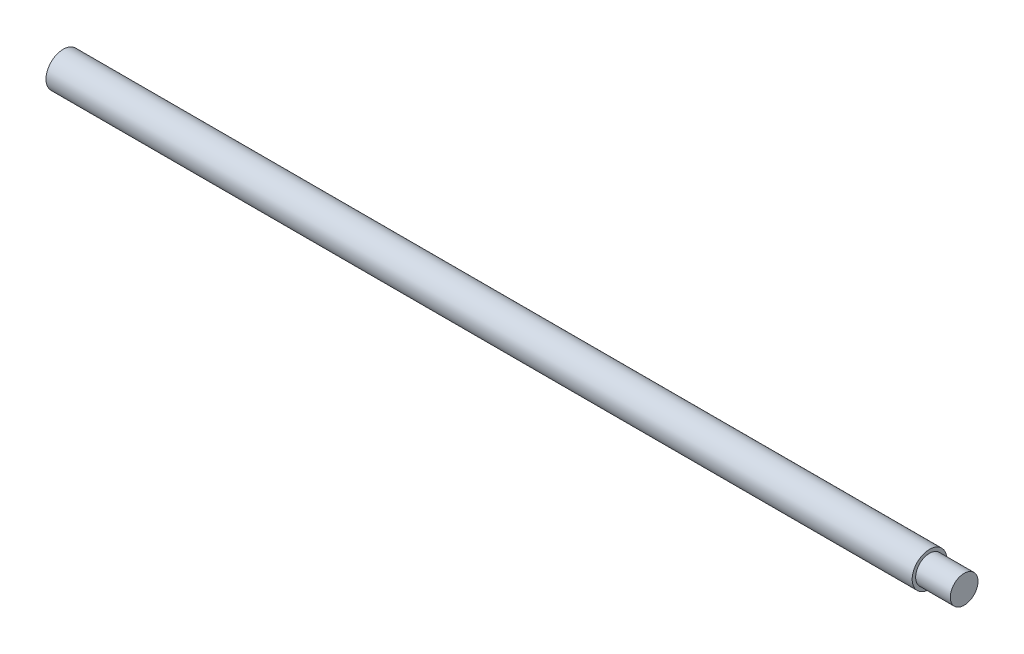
ISO-10303-21;
HEADER;
FILE_DESCRIPTION(('STEP AP214'),'2;1');
FILE_NAME('part.step','',(''),(''),'','','');
FILE_SCHEMA(('AUTOMOTIVE_DESIGN { 1 0 10303 214 1 1 1 1 }'));
ENDSEC;
DATA;
#1=APPLICATION_CONTEXT('core data for automotive mechanical design processes');
#2=APPLICATION_PROTOCOL_DEFINITION('international standard','automotive_design',2000,#1);
#3=PRODUCT_CONTEXT('',#1,'mechanical');
#4=PRODUCT('Part','Part','',(#3));
#5=PRODUCT_RELATED_PRODUCT_CATEGORY('part','',(#4));
#6=PRODUCT_DEFINITION_FORMATION('','',#4);
#7=PRODUCT_DEFINITION_CONTEXT('part definition',#1,'design');
#8=PRODUCT_DEFINITION('design','',#6,#7);
#9=PRODUCT_DEFINITION_SHAPE('','',#8);
#10=(LENGTH_UNIT() NAMED_UNIT(*) SI_UNIT(.MILLI.,.METRE.));
#11=(NAMED_UNIT(*) PLANE_ANGLE_UNIT() SI_UNIT($,.RADIAN.));
#12=(NAMED_UNIT(*) SI_UNIT($,.STERADIAN.) SOLID_ANGLE_UNIT());
#13=UNCERTAINTY_MEASURE_WITH_UNIT(LENGTH_MEASURE(1.E-05),#10,'distance_accuracy_value','');
#14=(GEOMETRIC_REPRESENTATION_CONTEXT(3) GLOBAL_UNCERTAINTY_ASSIGNED_CONTEXT((#13)) GLOBAL_UNIT_ASSIGNED_CONTEXT((#10,
#11,#12)) REPRESENTATION_CONTEXT('',''));
#15=CARTESIAN_POINT('',(0.,0.,0.));
#16=DIRECTION('',(0.,0.,1.));
#17=DIRECTION('',(1.,0.,0.));
#18=AXIS2_PLACEMENT_3D('',#15,#16,#17);
#19=CARTESIAN_POINT('',(10.,0.,0.));
#20=DIRECTION('',(1.,0.,0.));
#21=DIRECTION('',(0.,0.,-1.));
#22=AXIS2_PLACEMENT_3D('',#19,#20,#21);
#23=PLANE('',#22);
#24=CARTESIAN_POINT('',(10.,0.,0.));
#25=DIRECTION('',(1.,0.,0.));
#26=DIRECTION('',(0.,0.,-1.));
#27=AXIS2_PLACEMENT_3D('',#24,#25,#26);
#28=CIRCLE('',#27,4.);
#29=CARTESIAN_POINT('',(10.,0.,-4.));
#30=VERTEX_POINT('',#29);
#31=EDGE_CURVE('E17',#30,#30,#28,.F.);
#32=ORIENTED_EDGE('',*,*,#31,.F.);
#33=EDGE_LOOP('',(#32));
#34=FACE_BOUND('',#33,.T.);
#35=ADVANCED_FACE('F14',(#34),#23,.T.);
#36=CARTESIAN_POINT('',(0.,0.,0.));
#37=DIRECTION('',(1.,0.,0.));
#38=DIRECTION('',(0.,0.,-1.));
#39=AXIS2_PLACEMENT_3D('',#36,#37,#38);
#40=CYLINDRICAL_SURFACE('',#39,4.);
#41=ORIENTED_EDGE('',*,*,#31,.T.);
#42=EDGE_LOOP('',(#41));
#43=FACE_BOUND('',#42,.T.);
#44=CARTESIAN_POINT('',(0.,0.,0.));
#45=DIRECTION('',(1.,0.,0.));
#46=DIRECTION('',(0.,0.,-1.));
#47=AXIS2_PLACEMENT_3D('',#44,#45,#46);
#48=CIRCLE('',#47,4.);
#49=CARTESIAN_POINT('',(0.,0.,-4.));
#50=VERTEX_POINT('',#49);
#51=EDGE_CURVE('E26',#50,#50,#48,.F.);
#52=ORIENTED_EDGE('',*,*,#51,.F.);
#53=EDGE_LOOP('',(#52));
#54=FACE_BOUND('',#53,.T.);
#55=ADVANCED_FACE('F34',(#43,#54),#40,.T.);
#56=CARTESIAN_POINT('',(0.,0.,0.));
#57=DIRECTION('',(1.,0.,0.));
#58=DIRECTION('',(0.,0.,-1.));
#59=AXIS2_PLACEMENT_3D('',#56,#57,#58);
#60=PLANE('',#59);
#61=ORIENTED_EDGE('',*,*,#51,.T.);
#62=EDGE_LOOP('',(#61));
#63=FACE_BOUND('',#62,.T.);
#64=CARTESIAN_POINT('',(0.,0.,0.));
#65=DIRECTION('',(1.,0.,0.));
#66=DIRECTION('',(0.,0.,-1.));
#67=AXIS2_PLACEMENT_3D('',#64,#65,#66);
#68=CIRCLE('',#67,5.);
#69=CARTESIAN_POINT('',(0.,0.,-5.));
#70=VERTEX_POINT('',#69);
#71=EDGE_CURVE('E21',#70,#70,#68,.F.);
#72=ORIENTED_EDGE('',*,*,#71,.F.);
#73=EDGE_LOOP('',(#72));
#74=FACE_BOUND('',#73,.T.);
#75=ADVANCED_FACE('F42',(#63,#74),#60,.T.);
#76=CARTESIAN_POINT('',(-250.,0.,0.));
#77=DIRECTION('',(1.,0.,0.));
#78=DIRECTION('',(0.,0.,-1.));
#79=AXIS2_PLACEMENT_3D('',#76,#77,#78);
#80=PLANE('',#79);
#81=CARTESIAN_POINT('',(-250.,0.,0.));
#82=DIRECTION('',(1.,0.,0.));
#83=DIRECTION('',(0.,0.,-1.));
#84=AXIS2_PLACEMENT_3D('',#81,#82,#83);
#85=CIRCLE('',#84,5.);
#86=CARTESIAN_POINT('',(-250.,0.,-5.));
#87=VERTEX_POINT('',#86);
#88=EDGE_CURVE('E10',#87,#87,#85,.T.);
#89=ORIENTED_EDGE('',*,*,#88,.F.);
#90=EDGE_LOOP('',(#89));
#91=FACE_BOUND('',#90,.T.);
#92=ADVANCED_FACE('F45',(#91),#80,.F.);
#93=CARTESIAN_POINT('',(-262.5,0.,0.));
#94=DIRECTION('',(1.,0.,0.));
#95=DIRECTION('',(0.,0.,-1.));
#96=AXIS2_PLACEMENT_3D('',#93,#94,#95);
#97=CYLINDRICAL_SURFACE('',#96,5.);
#98=ORIENTED_EDGE('',*,*,#88,.T.);
#99=EDGE_LOOP('',(#98));
#100=FACE_BOUND('',#99,.T.);
#101=ORIENTED_EDGE('',*,*,#71,.T.);
#102=EDGE_LOOP('',(#101));
#103=FACE_BOUND('',#102,.T.);
#104=ADVANCED_FACE('F43',(#100,#103),#97,.T.);
#105=CLOSED_SHELL('',(#35,#55,#75,#92,#104));
#106=MANIFOLD_SOLID_BREP('B1',#105);
#107=ADVANCED_BREP_SHAPE_REPRESENTATION('',(#18,#106),#14);
#108=SHAPE_DEFINITION_REPRESENTATION(#9,#107);
ENDSEC;
END-ISO-10303-21;
